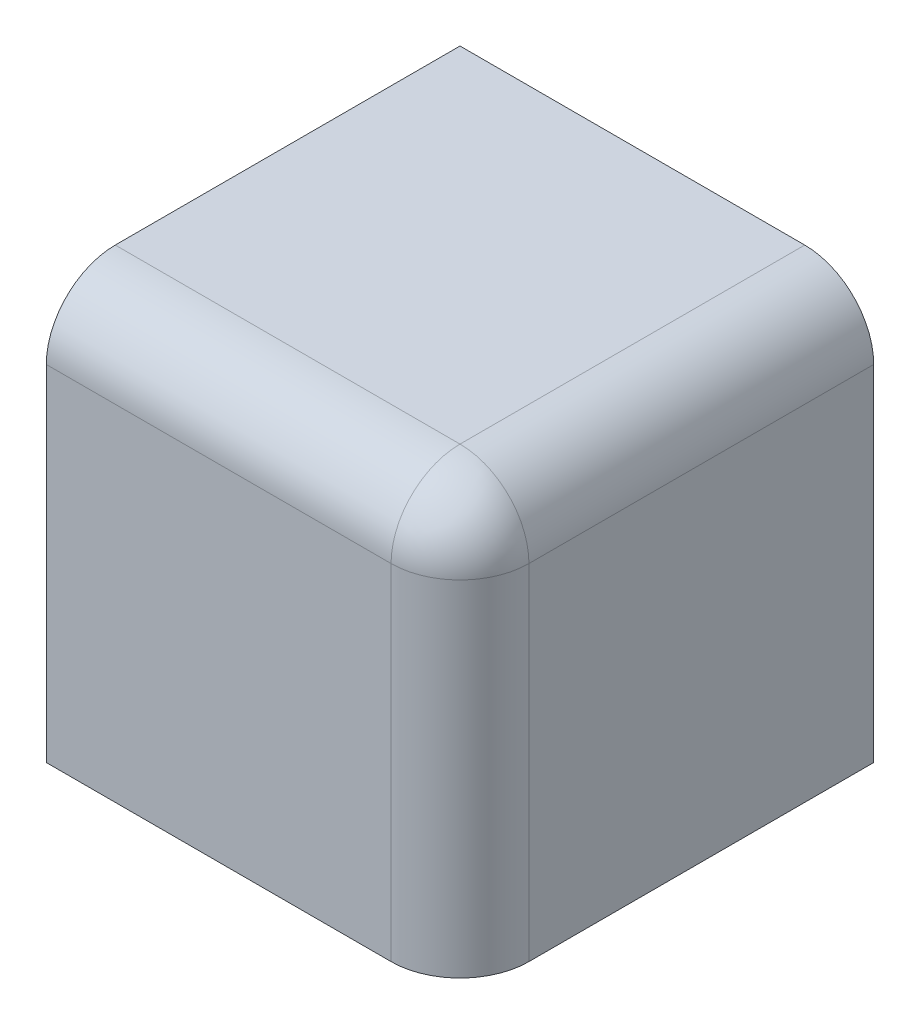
from build123d import *

# Parameters (mm, degrees)
SKETCH1_W           = 152.4
SKETCH1_H           = 152.4
BOSS_EXTRUDE1_DEPTH = 152.4
FILLET1_R           = 25.4


with BuildPart() as part:
    # Sketch1 → Boss-Extrude1 (new body)
    with BuildSketch(Plane(origin=(0, 0, 0), x_dir=(1, 0, 0), z_dir=(0, 1, 0))):
        Rectangle(SKETCH1_W, SKETCH1_H)
    extrude(amount=BOSS_EXTRUDE1_DEPTH)

    # Fillet1
    fillet1_edges = [part.edges().sort_by_distance(p)[0] for p in [
        (0, 152.4, 76.2),
        (76.2, 152.4, 0),
        (76.2, 76.2, 76.2),
    ]]
    fillet(fillet1_edges, radius=FILLET1_R)


solid = part.part
